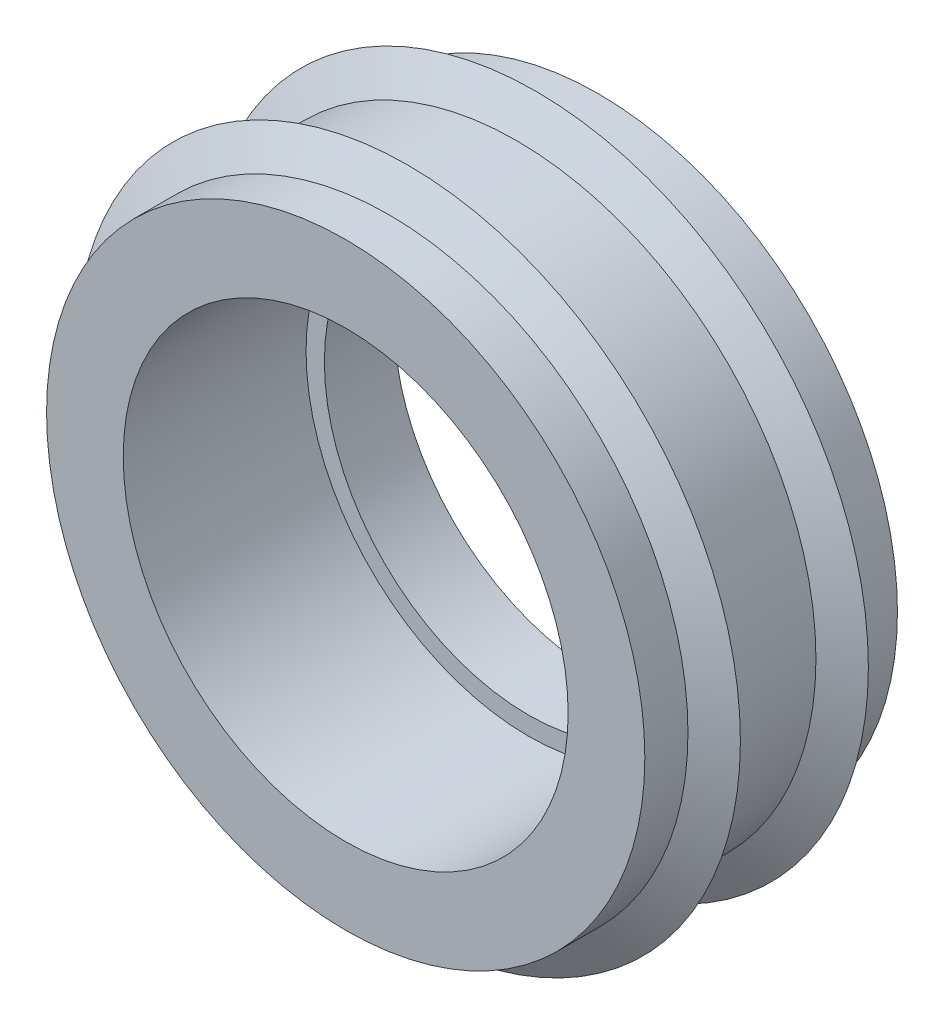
ISO-10303-21;
HEADER;
FILE_DESCRIPTION(('STEP AP214'),'2;1');
FILE_NAME('part.step','',(''),(''),'','','');
FILE_SCHEMA(('AUTOMOTIVE_DESIGN { 1 0 10303 214 1 1 1 1 }'));
ENDSEC;
DATA;
#1=APPLICATION_CONTEXT('core data for automotive mechanical design processes');
#2=APPLICATION_PROTOCOL_DEFINITION('international standard','automotive_design',2000,#1);
#3=PRODUCT_CONTEXT('',#1,'mechanical');
#4=PRODUCT('Part','Part','',(#3));
#5=PRODUCT_RELATED_PRODUCT_CATEGORY('part','',(#4));
#6=PRODUCT_DEFINITION_FORMATION('','',#4);
#7=PRODUCT_DEFINITION_CONTEXT('part definition',#1,'design');
#8=PRODUCT_DEFINITION('design','',#6,#7);
#9=PRODUCT_DEFINITION_SHAPE('','',#8);
#10=(LENGTH_UNIT() NAMED_UNIT(*) SI_UNIT(.MILLI.,.METRE.));
#11=(NAMED_UNIT(*) PLANE_ANGLE_UNIT() SI_UNIT($,.RADIAN.));
#12=(NAMED_UNIT(*) SI_UNIT($,.STERADIAN.) SOLID_ANGLE_UNIT());
#13=UNCERTAINTY_MEASURE_WITH_UNIT(LENGTH_MEASURE(1.E-05),#10,'distance_accuracy_value','');
#14=(GEOMETRIC_REPRESENTATION_CONTEXT(3) GLOBAL_UNCERTAINTY_ASSIGNED_CONTEXT((#13)) GLOBAL_UNIT_ASSIGNED_CONTEXT((#10,
#11,#12)) REPRESENTATION_CONTEXT('',''));
#15=CARTESIAN_POINT('',(0.,0.,0.));
#16=DIRECTION('',(0.,0.,1.));
#17=DIRECTION('',(1.,0.,0.));
#18=AXIS2_PLACEMENT_3D('',#15,#16,#17);
#19=CARTESIAN_POINT('',(-9.0994992,-9.0994992,2.667));
#20=DIRECTION('',(0.,0.,1.));
#21=DIRECTION('',(1.,0.,0.));
#22=AXIS2_PLACEMENT_3D('',#19,#20,#21);
#23=PLANE('',#22);
#24=CARTESIAN_POINT('',(0.,0.,2.667));
#25=DIRECTION('',(0.,0.,1.));
#26=DIRECTION('',(1.,0.,0.));
#27=AXIS2_PLACEMENT_3D('',#24,#25,#26);
#28=CIRCLE('',#27,7.8);
#29=CARTESIAN_POINT('',(7.8,0.,2.667));
#30=VERTEX_POINT('',#29);
#31=EDGE_CURVE('E29',#30,#30,#28,.F.);
#32=ORIENTED_EDGE('',*,*,#31,.T.);
#33=EDGE_LOOP('',(#32));
#34=FACE_BOUND('',#33,.T.);
#35=CARTESIAN_POINT('',(0.,0.,2.667));
#36=DIRECTION('',(0.,0.,1.));
#37=DIRECTION('',(1.,0.,0.));
#38=AXIS2_PLACEMENT_3D('',#35,#36,#37);
#39=CIRCLE('',#38,8.5);
#40=CARTESIAN_POINT('',(8.5,0.,2.667));
#41=VERTEX_POINT('',#40);
#42=EDGE_CURVE('E46',#41,#41,#39,.F.);
#43=ORIENTED_EDGE('',*,*,#42,.F.);
#44=EDGE_LOOP('',(#43));
#45=FACE_BOUND('',#44,.T.);
#46=ADVANCED_FACE('F12',(#34,#45),#23,.T.);
#47=CARTESIAN_POINT('',(0.,0.,6.537515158));
#48=DIRECTION('',(0.,0.,1.));
#49=DIRECTION('',(0.,-1.,0.));
#50=AXIS2_PLACEMENT_3D('',#47,#48,#49);
#51=CONICAL_SURFACE('',#50,11.43,1.04719755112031);
#52=CARTESIAN_POINT('',(0.,0.,7.27075));
#53=DIRECTION('',(0.,0.,-1.));
#54=DIRECTION('',(-1.,0.,0.));
#55=AXIS2_PLACEMENT_3D('',#52,#53,#54);
#56=CIRCLE('',#55,12.7);
#57=CARTESIAN_POINT('',(-12.7,0.,7.27075));
#58=VERTEX_POINT('',#57);
#59=EDGE_CURVE('E28',#58,#58,#56,.T.);
#60=ORIENTED_EDGE('',*,*,#59,.T.);
#61=EDGE_LOOP('',(#60));
#62=FACE_BOUND('',#61,.T.);
#63=CARTESIAN_POINT('',(0.,0.,6.537515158));
#64=DIRECTION('',(0.,0.,1.));
#65=DIRECTION('',(1.,0.,0.));
#66=AXIS2_PLACEMENT_3D('',#63,#64,#65);
#67=CIRCLE('',#66,11.43);
#68=CARTESIAN_POINT('',(11.43,0.,6.537515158));
#69=VERTEX_POINT('',#68);
#70=EDGE_CURVE('E25',#69,#69,#67,.T.);
#71=ORIENTED_EDGE('',*,*,#70,.T.);
#72=EDGE_LOOP('',(#71));
#73=FACE_BOUND('',#72,.T.);
#74=ADVANCED_FACE('F75',(#62,#73),#51,.T.);
#75=CARTESIAN_POINT('',(0.,0.,3.114484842));
#76=DIRECTION('',(0.,0.,1.));
#77=DIRECTION('',(1.,0.,0.));
#78=AXIS2_PLACEMENT_3D('',#75,#76,#77);
#79=CYLINDRICAL_SURFACE('',#78,11.43);
#80=CARTESIAN_POINT('',(0.,0.,3.11448484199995));
#81=DIRECTION('',(0.,0.,-1.));
#82=DIRECTION('',(-1.,0.,0.));
#83=AXIS2_PLACEMENT_3D('',#80,#81,#82);
#84=CIRCLE('',#83,11.43);
#85=CARTESIAN_POINT('',(-11.43,0.,3.114484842));
#86=VERTEX_POINT('',#85);
#87=EDGE_CURVE('E32',#86,#86,#84,.F.);
#88=ORIENTED_EDGE('',*,*,#87,.T.);
#89=EDGE_LOOP('',(#88));
#90=FACE_BOUND('',#89,.T.);
#91=ORIENTED_EDGE('',*,*,#70,.F.);
#92=EDGE_LOOP('',(#91));
#93=FACE_BOUND('',#92,.T.);
#94=ADVANCED_FACE('F81',(#90,#93),#79,.T.);
#95=CARTESIAN_POINT('',(0.,0.,8.003984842));
#96=DIRECTION('',(0.,0.,-1.));
#97=DIRECTION('',(-1.,0.,0.));
#98=AXIS2_PLACEMENT_3D('',#95,#96,#97);
#99=CONICAL_SURFACE('',#98,11.43,1.04719755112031);
#100=ORIENTED_EDGE('',*,*,#59,.F.);
#101=EDGE_LOOP('',(#100));
#102=FACE_BOUND('',#101,.T.);
#103=CARTESIAN_POINT('',(0.,0.,8.003984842));
#104=DIRECTION('',(0.,0.,1.));
#105=DIRECTION('',(1.,0.,0.));
#106=AXIS2_PLACEMENT_3D('',#103,#104,#105);
#107=CIRCLE('',#106,11.43);
#108=CARTESIAN_POINT('',(11.43,0.,8.003984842));
#109=VERTEX_POINT('',#108);
#110=EDGE_CURVE('E35',#109,#109,#107,.F.);
#111=ORIENTED_EDGE('',*,*,#110,.T.);
#112=EDGE_LOOP('',(#111));
#113=FACE_BOUND('',#112,.T.);
#114=ADVANCED_FACE('F106',(#102,#113),#99,.T.);
#115=CARTESIAN_POINT('',(0.,0.,3.114484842));
#116=DIRECTION('',(0.,0.,-1.));
#117=DIRECTION('',(-1.,0.,0.));
#118=AXIS2_PLACEMENT_3D('',#115,#116,#117);
#119=CONICAL_SURFACE('',#118,11.43,1.04719755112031);
#120=ORIENTED_EDGE('',*,*,#87,.F.);
#121=EDGE_LOOP('',(#120));
#122=FACE_BOUND('',#121,.T.);
#123=CARTESIAN_POINT('',(0.,0.,2.38125));
#124=DIRECTION('',(0.,0.,1.));
#125=DIRECTION('',(1.,0.,0.));
#126=AXIS2_PLACEMENT_3D('',#123,#124,#125);
#127=CIRCLE('',#126,12.7);
#128=CARTESIAN_POINT('',(12.7,0.,2.38124999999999));
#129=VERTEX_POINT('',#128);
#130=EDGE_CURVE('E38',#129,#129,#127,.T.);
#131=ORIENTED_EDGE('',*,*,#130,.T.);
#132=EDGE_LOOP('',(#131));
#133=FACE_BOUND('',#132,.T.);
#134=ADVANCED_FACE('F110',(#122,#133),#119,.T.);
#135=CARTESIAN_POINT('',(0.,0.,8.003984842));
#136=DIRECTION('',(0.,0.,1.));
#137=DIRECTION('',(1.,0.,0.));
#138=AXIS2_PLACEMENT_3D('',#135,#136,#137);
#139=CYLINDRICAL_SURFACE('',#138,11.43);
#140=CARTESIAN_POINT('',(0.,0.,9.652));
#141=DIRECTION('',(0.,0.,1.));
#142=DIRECTION('',(1.,0.,0.));
#143=AXIS2_PLACEMENT_3D('',#140,#141,#142);
#144=CIRCLE('',#143,11.43);
#145=CARTESIAN_POINT('',(11.43,0.,9.652));
#146=VERTEX_POINT('',#145);
#147=EDGE_CURVE('E15',#146,#146,#144,.T.);
#148=ORIENTED_EDGE('',*,*,#147,.F.);
#149=EDGE_LOOP('',(#148));
#150=FACE_BOUND('',#149,.T.);
#151=ORIENTED_EDGE('',*,*,#110,.F.);
#152=EDGE_LOOP('',(#151));
#153=FACE_BOUND('',#152,.T.);
#154=ADVANCED_FACE('F70',(#150,#153),#139,.T.);
#155=CARTESIAN_POINT('',(0.,0.,1.648015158));
#156=DIRECTION('',(0.,0.,1.));
#157=DIRECTION('',(1.,0.,0.));
#158=AXIS2_PLACEMENT_3D('',#155,#156,#157);
#159=CONICAL_SURFACE('',#158,11.43,1.04719755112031);
#160=CARTESIAN_POINT('',(0.,0.,1.648015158));
#161=DIRECTION('',(0.,0.,1.));
#162=DIRECTION('',(1.,0.,0.));
#163=AXIS2_PLACEMENT_3D('',#160,#161,#162);
#164=CIRCLE('',#163,11.43);
#165=CARTESIAN_POINT('',(11.43,0.,1.648015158));
#166=VERTEX_POINT('',#165);
#167=EDGE_CURVE('E19',#166,#166,#164,.T.);
#168=ORIENTED_EDGE('',*,*,#167,.T.);
#169=EDGE_LOOP('',(#168));
#170=FACE_BOUND('',#169,.T.);
#171=ORIENTED_EDGE('',*,*,#130,.F.);
#172=EDGE_LOOP('',(#171));
#173=FACE_BOUND('',#172,.T.);
#174=ADVANCED_FACE('F58',(#170,#173),#159,.T.);
#175=CARTESIAN_POINT('',(-11.56716,-11.566398,9.652));
#176=DIRECTION('',(0.,0.,1.));
#177=DIRECTION('',(1.,0.,0.));
#178=AXIS2_PLACEMENT_3D('',#175,#176,#177);
#179=PLANE('',#178);
#180=ORIENTED_EDGE('',*,*,#147,.T.);
#181=EDGE_LOOP('',(#180));
#182=FACE_BOUND('',#181,.T.);
#183=CARTESIAN_POINT('',(0.,0.,9.652));
#184=DIRECTION('',(0.,0.,1.));
#185=DIRECTION('',(1.,0.,0.));
#186=AXIS2_PLACEMENT_3D('',#183,#184,#185);
#187=CIRCLE('',#186,8.5);
#188=CARTESIAN_POINT('',(8.5,0.,9.652));
#189=VERTEX_POINT('',#188);
#190=EDGE_CURVE('E49',#189,#189,#187,.T.);
#191=ORIENTED_EDGE('',*,*,#190,.F.);
#192=EDGE_LOOP('',(#191));
#193=FACE_BOUND('',#192,.T.);
#194=ADVANCED_FACE('F55',(#182,#193),#179,.T.);
#195=CARTESIAN_POINT('',(0.,0.,0.));
#196=DIRECTION('',(0.,0.,1.));
#197=DIRECTION('',(1.,0.,0.));
#198=AXIS2_PLACEMENT_3D('',#195,#196,#197);
#199=CYLINDRICAL_SURFACE('',#198,11.43);
#200=CARTESIAN_POINT('',(0.,0.,0.));
#201=DIRECTION('',(0.,0.,1.));
#202=DIRECTION('',(1.,0.,0.));
#203=AXIS2_PLACEMENT_3D('',#200,#201,#202);
#204=CIRCLE('',#203,11.43);
#205=CARTESIAN_POINT('',(11.43,0.,0.));
#206=VERTEX_POINT('',#205);
#207=EDGE_CURVE('E8',#206,#206,#204,.F.);
#208=ORIENTED_EDGE('',*,*,#207,.F.);
#209=EDGE_LOOP('',(#208));
#210=FACE_BOUND('',#209,.T.);
#211=ORIENTED_EDGE('',*,*,#167,.F.);
#212=EDGE_LOOP('',(#211));
#213=FACE_BOUND('',#212,.T.);
#214=ADVANCED_FACE('F57',(#210,#213),#199,.T.);
#215=CARTESIAN_POINT('',(11.56716,-11.56716,0.));
#216=DIRECTION('',(0.,0.,-1.));
#217=DIRECTION('',(-1.,0.,0.));
#218=AXIS2_PLACEMENT_3D('',#215,#216,#217);
#219=PLANE('',#218);
#220=ORIENTED_EDGE('',*,*,#207,.T.);
#221=EDGE_LOOP('',(#220));
#222=FACE_BOUND('',#221,.T.);
#223=CARTESIAN_POINT('',(0.,0.,0.));
#224=DIRECTION('',(0.,0.,-1.));
#225=DIRECTION('',(-1.,0.,0.));
#226=AXIS2_PLACEMENT_3D('',#223,#224,#225);
#227=CIRCLE('',#226,7.8);
#228=CARTESIAN_POINT('',(-7.8,0.,0.));
#229=VERTEX_POINT('',#228);
#230=EDGE_CURVE('E43',#229,#229,#227,.T.);
#231=ORIENTED_EDGE('',*,*,#230,.F.);
#232=EDGE_LOOP('',(#231));
#233=FACE_BOUND('',#232,.T.);
#234=ADVANCED_FACE('F67',(#222,#233),#219,.T.);
#235=CARTESIAN_POINT('',(0.,0.,28.8201616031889));
#236=DIRECTION('',(0.,0.,-1.));
#237=DIRECTION('',(-1.,0.,0.));
#238=AXIS2_PLACEMENT_3D('',#235,#236,#237);
#239=CYLINDRICAL_SURFACE('',#238,7.8);
#240=ORIENTED_EDGE('',*,*,#230,.T.);
#241=EDGE_LOOP('',(#240));
#242=FACE_BOUND('',#241,.T.);
#243=ORIENTED_EDGE('',*,*,#31,.F.);
#244=EDGE_LOOP('',(#243));
#245=FACE_BOUND('',#244,.T.);
#246=ADVANCED_FACE('F84',(#242,#245),#239,.F.);
#247=CARTESIAN_POINT('',(0.,0.,-25.4991350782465));
#248=DIRECTION('',(0.,0.,1.));
#249=DIRECTION('',(1.,0.,0.));
#250=AXIS2_PLACEMENT_3D('',#247,#248,#249);
#251=CYLINDRICAL_SURFACE('',#250,8.5);
#252=ORIENTED_EDGE('',*,*,#42,.T.);
#253=EDGE_LOOP('',(#252));
#254=FACE_BOUND('',#253,.T.);
#255=ORIENTED_EDGE('',*,*,#190,.T.);
#256=EDGE_LOOP('',(#255));
#257=FACE_BOUND('',#256,.T.);
#258=ADVANCED_FACE('F53',(#254,#257),#251,.F.);
#259=CLOSED_SHELL('',(#46,#74,#94,#114,#134,#154,#174,#194,#214,#234,#246,#258));
#260=MANIFOLD_SOLID_BREP('B1',#259);
#261=ADVANCED_BREP_SHAPE_REPRESENTATION('',(#18,#260),#14);
#262=SHAPE_DEFINITION_REPRESENTATION(#9,#261);
ENDSEC;
END-ISO-10303-21;
